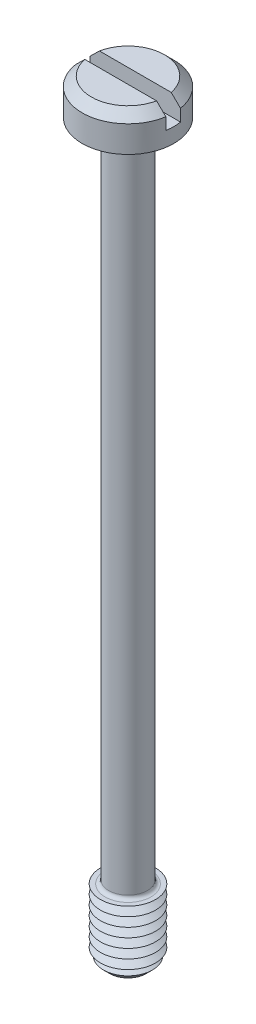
ISO-10303-21;
HEADER;
FILE_DESCRIPTION(('STEP AP214'),'2;1');
FILE_NAME('part.step','',(''),(''),'','','');
FILE_SCHEMA(('AUTOMOTIVE_DESIGN { 1 0 10303 214 1 1 1 1 }'));
ENDSEC;
DATA;
#1=APPLICATION_CONTEXT('core data for automotive mechanical design processes');
#2=APPLICATION_PROTOCOL_DEFINITION('international standard','automotive_design',2000,#1);
#3=PRODUCT_CONTEXT('',#1,'mechanical');
#4=PRODUCT('Part','Part','',(#3));
#5=PRODUCT_RELATED_PRODUCT_CATEGORY('part','',(#4));
#6=PRODUCT_DEFINITION_FORMATION('','',#4);
#7=PRODUCT_DEFINITION_CONTEXT('part definition',#1,'design');
#8=PRODUCT_DEFINITION('design','',#6,#7);
#9=PRODUCT_DEFINITION_SHAPE('','',#8);
#10=(LENGTH_UNIT() NAMED_UNIT(*) SI_UNIT(.MILLI.,.METRE.));
#11=(NAMED_UNIT(*) PLANE_ANGLE_UNIT() SI_UNIT($,.RADIAN.));
#12=(NAMED_UNIT(*) SI_UNIT($,.STERADIAN.) SOLID_ANGLE_UNIT());
#13=UNCERTAINTY_MEASURE_WITH_UNIT(LENGTH_MEASURE(1.E-05),#10,'distance_accuracy_value','');
#14=(GEOMETRIC_REPRESENTATION_CONTEXT(3) GLOBAL_UNCERTAINTY_ASSIGNED_CONTEXT((#13)) GLOBAL_UNIT_ASSIGNED_CONTEXT((#10,
#11,#12)) REPRESENTATION_CONTEXT('',''));
#15=CARTESIAN_POINT('',(0.,0.,0.));
#16=DIRECTION('',(0.,0.,1.));
#17=DIRECTION('',(1.,0.,0.));
#18=AXIS2_PLACEMENT_3D('',#15,#16,#17);
#19=CARTESIAN_POINT('',(0.,3.9,0.));
#20=DIRECTION('',(0.,1.,0.));
#21=DIRECTION('',(0.,0.,1.));
#22=AXIS2_PLACEMENT_3D('',#19,#20,#21);
#23=PLANE('',#22);
#24=DIRECTION('',(-1.,0.,0.));
#25=VECTOR('',#24,1.);
#26=CARTESIAN_POINT('',(5.,3.9,-0.8));
#27=LINE('',#26,#25);
#28=CARTESIAN_POINT('',(3.9191835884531,3.9,-0.8));
#29=VERTEX_POINT('',#28);
#30=CARTESIAN_POINT('',(-3.9191835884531,3.9,-0.8));
#31=VERTEX_POINT('',#30);
#32=EDGE_CURVE('E110',#29,#31,#27,.T.);
#33=ORIENTED_EDGE('',*,*,#32,.F.);
#34=CARTESIAN_POINT('',(0.,3.9,0.));
#35=DIRECTION('',(0.,1.,0.));
#36=DIRECTION('',(0.,0.,1.));
#37=AXIS2_PLACEMENT_3D('',#34,#35,#36);
#38=CIRCLE('',#37,4.00000000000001);
#39=EDGE_CURVE('E113',#29,#31,#38,.T.);
#40=ORIENTED_EDGE('',*,*,#39,.T.);
#41=EDGE_LOOP('',(#33,#40));
#42=FACE_BOUND('',#41,.T.);
#43=ADVANCED_FACE('F39',(#42),#23,.T.);
#44=CARTESIAN_POINT('',(0.,3.9,0.));
#45=DIRECTION('',(0.,-1.,0.));
#46=DIRECTION('',(0.,0.,-1.));
#47=AXIS2_PLACEMENT_3D('',#44,#45,#46);
#48=CONICAL_SURFACE('',#47,4.00000000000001,0.785398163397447);
#49=CARTESIAN_POINT('',(11.0010756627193,-3.13012537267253,-0.8));
#50=CARTESIAN_POINT('',(10.6180645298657,-2.74813121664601,-0.8));
#51=CARTESIAN_POINT('',(10.2350087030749,-2.3661818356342,-0.8));
#52=CARTESIAN_POINT('',(9.46873746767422,-1.60241986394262,-0.8));
#53=CARTESIAN_POINT('',(9.08552205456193,-1.22060727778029,-0.8));
#54=CARTESIAN_POINT('',(8.31861292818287,-0.456918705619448,-0.8));
#55=CARTESIAN_POINT('',(7.93491906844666,-0.0750428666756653,-0.8));
#56=CARTESIAN_POINT('',(7.16722555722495,0.688378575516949,-0.8));
#57=CARTESIAN_POINT('',(6.78322591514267,1.06992418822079,-0.8));
#58=CARTESIAN_POINT('',(6.01856215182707,1.82868912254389,-0.8));
#59=CARTESIAN_POINT('',(5.63790309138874,2.20591354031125,-0.8));
#60=CARTESIAN_POINT('',(5.06622054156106,2.77108317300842,-0.8));
#61=CARTESIAN_POINT('',(4.87553531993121,2.95937045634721,-0.8));
#62=CARTESIAN_POINT('',(4.49384424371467,3.33561647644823,-0.8));
#63=CARTESIAN_POINT('',(4.302838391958,3.52357521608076,-0.8));
#64=CARTESIAN_POINT('',(3.92044271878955,3.89893397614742,-0.8));
#65=CARTESIAN_POINT('',(3.7290531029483,4.08633420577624,-0.8));
#66=CARTESIAN_POINT('',(3.34554223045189,4.46039762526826,-0.8));
#67=CARTESIAN_POINT('',(3.15342094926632,4.64706078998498,-0.8));
#68=CARTESIAN_POINT('',(2.76802565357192,5.0191369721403,-0.8));
#69=CARTESIAN_POINT('',(2.57475182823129,5.20455018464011,-0.8));
#70=CARTESIAN_POINT('',(2.28318236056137,5.48091108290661,-0.8));
#71=CARTESIAN_POINT('',(2.1857187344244,5.5727357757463,-0.8));
#72=CARTESIAN_POINT('',(1.98998431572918,5.75552004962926,-0.8));
#73=CARTESIAN_POINT('',(1.89171354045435,5.84647964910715,-0.8));
#74=CARTESIAN_POINT('',(1.76578543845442,5.96147491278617,-0.8));
#75=CARTESIAN_POINT('',(1.73869031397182,5.986126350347,-0.8));
#76=CARTESIAN_POINT('',(1.68439529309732,6.03531372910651,-0.8));
#77=CARTESIAN_POINT('',(1.65719539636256,6.05984966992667,-0.8));
#78=CARTESIAN_POINT('',(1.57541627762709,6.13326356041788,-0.8));
#79=CARTESIAN_POINT('',(1.52066027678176,6.18194515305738,-0.8));
#80=CARTESIAN_POINT('',(1.41038257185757,6.27874171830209,-0.8));
#81=CARTESIAN_POINT('',(1.35485918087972,6.32685477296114,-0.8));
#82=CARTESIAN_POINT('',(1.24299231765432,6.42210730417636,-0.8));
#83=CARTESIAN_POINT('',(1.18664895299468,6.46924690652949,-0.8));
#84=CARTESIAN_POINT('',(1.07845249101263,6.55754663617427,-0.8));
#85=CARTESIAN_POINT('',(1.02670624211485,6.59883713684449,-0.8));
#86=CARTESIAN_POINT('',(0.921961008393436,6.67979338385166,-0.8));
#87=CARTESIAN_POINT('',(0.868962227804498,6.7194593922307,-0.8));
#88=CARTESIAN_POINT('',(0.761295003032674,6.79630361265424,-0.8));
#89=CARTESIAN_POINT('',(0.706629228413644,6.83348552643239,-0.8));
#90=CARTESIAN_POINT('',(0.594896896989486,6.90399895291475,-0.8));
#91=CARTESIAN_POINT('',(0.537833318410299,6.93733506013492,-0.8));
#92=CARTESIAN_POINT('',(0.428390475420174,6.99356340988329,-0.8));
#93=CARTESIAN_POINT('',(0.37643590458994,7.0172602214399,-0.8));
#94=CARTESIAN_POINT('',(0.269759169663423,7.05717670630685,-0.8));
#95=CARTESIAN_POINT('',(0.215046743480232,7.07342088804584,-0.8));
#96=CARTESIAN_POINT('',(0.113016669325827,7.09332110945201,-0.8));
#97=CARTESIAN_POINT('',(0.0660435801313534,7.09866042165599,-0.8));
#98=CARTESIAN_POINT('',(-0.0280587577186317,7.10088875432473,-0.8));
#99=CARTESIAN_POINT('',(-0.075187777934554,7.09778705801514,-0.8));
#100=CARTESIAN_POINT('',(-0.180723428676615,7.08192474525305,-0.8));
#101=CARTESIAN_POINT('',(-0.238762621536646,7.066795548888,-0.8));
#102=CARTESIAN_POINT('',(-0.323499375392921,7.03748409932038,-0.8));
#103=CARTESIAN_POINT('',(-0.351441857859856,7.0265659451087,-0.8));
#104=CARTESIAN_POINT('',(-0.406569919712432,7.00295901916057,-0.8));
#105=CARTESIAN_POINT('',(-0.433755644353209,6.99027059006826,-0.8));
#106=CARTESIAN_POINT('',(-0.504673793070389,6.95489235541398,-0.8));
#107=CARTESIAN_POINT('',(-0.547808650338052,6.93101671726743,-0.8));
#108=CARTESIAN_POINT('',(-0.632566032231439,6.88069648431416,-0.8));
#109=CARTESIAN_POINT('',(-0.674187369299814,6.85424992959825,-0.8));
#110=CARTESIAN_POINT('',(-0.756326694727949,6.79950439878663,-0.8));
#111=CARTESIAN_POINT('',(-0.796841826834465,6.77120117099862,-0.8));
#112=CARTESIAN_POINT('',(-0.876938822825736,6.71329852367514,-0.8));
#113=CARTESIAN_POINT('',(-0.916520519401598,6.68369887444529,-0.8));
#114=CARTESIAN_POINT('',(-1.03465904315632,6.59312324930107,-0.8));
#115=CARTESIAN_POINT('',(-1.11211338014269,6.53071425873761,-0.8));
#116=CARTESIAN_POINT('',(-1.26505454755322,6.40381418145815,-0.8));
#117=CARTESIAN_POINT('',(-1.34054439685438,6.33932667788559,-0.8));
#118=CARTESIAN_POINT('',(-1.48913173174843,6.20997083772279,-0.8));
#119=CARTESIAN_POINT('',(-1.56224816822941,6.14512422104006,-0.8));
#120=CARTESIAN_POINT('',(-1.7076539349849,6.01451044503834,-0.8));
#121=CARTESIAN_POINT('',(-1.77994324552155,5.94874326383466,-0.8));
#122=CARTESIAN_POINT('',(-1.99594639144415,5.75046596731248,-0.8));
#123=CARTESIAN_POINT('',(-2.13877767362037,5.61699583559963,-0.8));
#124=CARTESIAN_POINT('',(-2.42324632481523,5.34853800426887,-0.8));
#125=CARTESIAN_POINT('',(-2.56488247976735,5.21354902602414,-0.8));
#126=CARTESIAN_POINT('',(-2.84730929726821,4.94270932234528,-0.8));
#127=CARTESIAN_POINT('',(-2.98810001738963,4.80685865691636,-0.8));
#128=CARTESIAN_POINT('',(-3.2681876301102,4.53549974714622,-0.8));
#129=CARTESIAN_POINT('',(-3.4074882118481,4.39999530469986,-0.8));
#130=CARTESIAN_POINT('',(-3.68570899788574,4.12859172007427,-0.8));
#131=CARTESIAN_POINT('',(-3.82462919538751,3.99269257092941,-0.8));
#132=CARTESIAN_POINT('',(-4.24087543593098,3.58468153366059,-0.8));
#133=CARTESIAN_POINT('',(-4.5177930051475,3.31215310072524,-0.8));
#134=CARTESIAN_POINT('',(-5.052793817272,2.78443938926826,-0.8));
#135=CARTESIAN_POINT('',(-5.31091639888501,2.52929393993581,-0.8));
#136=CARTESIAN_POINT('',(-5.82680751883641,2.01864429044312,-0.8));
#137=CARTESIAN_POINT('',(-6.08457605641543,1.76314008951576,-0.8));
#138=CARTESIAN_POINT('',(-6.85760508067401,0.996194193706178,-0.8));
#139=CARTESIAN_POINT('',(-7.37251152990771,0.484395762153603,-0.8));
#140=CARTESIAN_POINT('',(-8.4065723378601,-0.544392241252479,-0.8));
#141=CARTESIAN_POINT('',(-8.92572224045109,-1.06138628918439,-0.8));
#142=CARTESIAN_POINT('',(-9.96362871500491,-2.09560660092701,-0.8));
#143=CARTESIAN_POINT('',(-10.4823853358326,-2.61283281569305,-0.8));
#144=CARTESIAN_POINT('',(-11.0010756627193,-3.13012537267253,-0.8));
#145=B_SPLINE_CURVE_WITH_KNOTS('',3,(#49,#50,#51,#52,#53,#54,#55,#56,#57,#58,#59,#60,#61,#62,
#63,#64,#65,#66,#67,#68,#69,#70,#71,#72,#73,#74,#75,#76,#77,#78,#79,#80,#81,#82,#83,#84,#85,#86,
#87,#88,#89,#90,#91,#92,#93,#94,#95,#96,#97,#98,#99,#100,#101,#102,#103,#104,#105,#106,#107,
#108,#109,#110,#111,#112,#113,#114,#115,#116,#117,#118,#119,#120,#121,#122,#123,#124,#125,#126,
#127,#128,#129,#130,#131,#132,#133,#134,#135,#136,#137,#138,#139,#140,#141,#142,#143,#144),
.UNSPECIFIED.,.F.,.F.,(4,2,2,2,2,2,2,2,2,2,2,2,2,2,2,2,2,2,2,2,2,2,2,2,2,2,2,2,2,2,2,2,2,2,2,2,
2,2,2,2,2,2,2,2,2,2,2,4),(0.,1.62282275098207,3.24569489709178,4.86971791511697,
6.49369278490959,8.10142191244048,8.90535980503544,9.7092906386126,10.5128682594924,
11.3164730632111,12.1199494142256,12.5216659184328,12.9233738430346,13.0332669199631,
13.1431603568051,13.3629580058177,13.5833578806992,13.8037290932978,14.0023112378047,
14.2008612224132,14.3991084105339,14.5971162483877,14.7680800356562,14.9384774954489,
15.0795987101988,15.2205647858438,15.3993585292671,15.4893211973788,15.5792664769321,
15.727032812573,15.8749126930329,16.0231439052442,16.1714014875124,16.4697244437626,
16.767558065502,17.0607348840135,17.35391868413,17.9403574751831,18.5273336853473,
19.1142694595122,19.6972736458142,20.2802881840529,21.4458742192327,22.5346981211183,
23.6235243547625,25.8015035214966,27.9995014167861,30.1971550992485),.UNSPECIFIED.);
#146=CARTESIAN_POINT('',(4.93558507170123,2.90000000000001,-0.8));
#147=VERTEX_POINT('',#146);
#148=EDGE_CURVE('E252',#147,#29,#145,.T.);
#149=ORIENTED_EDGE('',*,*,#148,.F.);
#150=CARTESIAN_POINT('',(0.,2.90000000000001,0.));
#151=DIRECTION('',(0.,1.,0.));
#152=DIRECTION('',(0.,0.,1.));
#153=AXIS2_PLACEMENT_3D('',#150,#151,#152);
#154=CIRCLE('',#153,5.);
#155=CARTESIAN_POINT('',(-4.93558507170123,2.90000000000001,-0.8));
#156=VERTEX_POINT('',#155);
#157=EDGE_CURVE('E128',#156,#147,#154,.F.);
#158=ORIENTED_EDGE('',*,*,#157,.F.);
#159=EDGE_CURVE('E102',#31,#156,#145,.T.);
#160=ORIENTED_EDGE('',*,*,#159,.F.);
#161=ORIENTED_EDGE('',*,*,#39,.F.);
#162=EDGE_LOOP('',(#149,#158,#160,#161));
#163=FACE_BOUND('',#162,.T.);
#164=ADVANCED_FACE('F214',(#163),#48,.T.);
#165=CARTESIAN_POINT('',(0.,-80.,0.));
#166=DIRECTION('',(0.,1.,0.));
#167=DIRECTION('',(0.,0.,1.));
#168=AXIS2_PLACEMENT_3D('',#165,#166,#167);
#169=CYLINDRICAL_SURFACE('',#168,2.1);
#170=CARTESIAN_POINT('',(0.,-72.1,0.));
#171=DIRECTION('',(0.,-1.,0.));
#172=DIRECTION('',(0.,0.,-1.));
#173=AXIS2_PLACEMENT_3D('',#170,#171,#172);
#174=CIRCLE('',#173,2.1);
#175=CARTESIAN_POINT('',(0.,-72.1,-2.1));
#176=VERTEX_POINT('',#175);
#177=EDGE_CURVE('E123',#176,#176,#174,.F.);
#178=ORIENTED_EDGE('',*,*,#177,.T.);
#179=EDGE_LOOP('',(#178));
#180=FACE_BOUND('',#179,.T.);
#181=CARTESIAN_POINT('',(0.,-0.399999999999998,0.));
#182=DIRECTION('',(0.,1.,0.));
#183=DIRECTION('',(0.,0.,1.));
#184=AXIS2_PLACEMENT_3D('',#181,#182,#183);
#185=CIRCLE('',#184,2.1);
#186=CARTESIAN_POINT('',(0.,-0.399999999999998,2.1));
#187=VERTEX_POINT('',#186);
#188=EDGE_CURVE('E349',#187,#187,#185,.F.);
#189=ORIENTED_EDGE('',*,*,#188,.T.);
#190=EDGE_LOOP('',(#189));
#191=FACE_BOUND('',#190,.T.);
#192=ADVANCED_FACE('F210',(#180,#191),#169,.T.);
#193=CARTESIAN_POINT('',(0.,3.9,0.));
#194=DIRECTION('',(0.,-1.,0.));
#195=DIRECTION('',(0.,0.,-1.));
#196=AXIS2_PLACEMENT_3D('',#193,#194,#195);
#197=CYLINDRICAL_SURFACE('',#196,5.);
#198=ORIENTED_EDGE('',*,*,#157,.T.);
#199=DIRECTION('',(0.,-1.,0.));
#200=VECTOR('',#199,1.);
#201=CARTESIAN_POINT('',(4.93558507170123,3.9,-0.8));
#202=LINE('',#201,#200);
#203=CARTESIAN_POINT('',(4.93558507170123,1.6,-0.8));
#204=VERTEX_POINT('',#203);
#205=EDGE_CURVE('E64',#147,#204,#202,.T.);
#206=ORIENTED_EDGE('',*,*,#205,.T.);
#207=CARTESIAN_POINT('',(0.,1.6,0.));
#208=DIRECTION('',(0.,1.,0.));
#209=DIRECTION('',(0.,0.,1.));
#210=AXIS2_PLACEMENT_3D('',#207,#208,#209);
#211=CIRCLE('',#210,5.);
#212=CARTESIAN_POINT('',(4.93558507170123,1.6,0.8));
#213=VERTEX_POINT('',#212);
#214=EDGE_CURVE('E11',#213,#204,#211,.T.);
#215=ORIENTED_EDGE('',*,*,#214,.F.);
#216=DIRECTION('',(0.,-1.,0.));
#217=VECTOR('',#216,1.);
#218=CARTESIAN_POINT('',(4.93558507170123,3.9,0.8));
#219=LINE('',#218,#217);
#220=CARTESIAN_POINT('',(4.93558507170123,2.90000000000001,0.8));
#221=VERTEX_POINT('',#220);
#222=EDGE_CURVE('E268',#213,#221,#219,.F.);
#223=ORIENTED_EDGE('',*,*,#222,.T.);
#224=CARTESIAN_POINT('',(-4.93558507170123,2.90000000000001,0.8));
#225=VERTEX_POINT('',#224);
#226=EDGE_CURVE('E120',#221,#225,#154,.F.);
#227=ORIENTED_EDGE('',*,*,#226,.T.);
#228=DIRECTION('',(0.,-1.,0.));
#229=VECTOR('',#228,1.);
#230=CARTESIAN_POINT('',(-4.93558507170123,3.9,0.8));
#231=LINE('',#230,#229);
#232=CARTESIAN_POINT('',(-4.93558507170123,1.6,0.8));
#233=VERTEX_POINT('',#232);
#234=EDGE_CURVE('E96',#225,#233,#231,.T.);
#235=ORIENTED_EDGE('',*,*,#234,.T.);
#236=CARTESIAN_POINT('',(-4.93558507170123,1.6,-0.8));
#237=VERTEX_POINT('',#236);
#238=EDGE_CURVE('E44',#237,#233,#211,.T.);
#239=ORIENTED_EDGE('',*,*,#238,.F.);
#240=DIRECTION('',(0.,-1.,0.));
#241=VECTOR('',#240,1.);
#242=CARTESIAN_POINT('',(-4.93558507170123,3.9,-0.8));
#243=LINE('',#242,#241);
#244=EDGE_CURVE('E271',#237,#156,#243,.F.);
#245=ORIENTED_EDGE('',*,*,#244,.T.);
#246=EDGE_LOOP('',(#198,#206,#215,#223,#227,#235,#239,#245));
#247=FACE_BOUND('',#246,.T.);
#248=CARTESIAN_POINT('',(0.,0.,0.));
#249=DIRECTION('',(0.,1.,0.));
#250=DIRECTION('',(0.,0.,1.));
#251=AXIS2_PLACEMENT_3D('',#248,#249,#250);
#252=CIRCLE('',#251,5.);
#253=CARTESIAN_POINT('',(0.,0.,5.));
#254=VERTEX_POINT('',#253);
#255=EDGE_CURVE('E334',#254,#254,#252,.T.);
#256=ORIENTED_EDGE('',*,*,#255,.T.);
#257=EDGE_LOOP('',(#256));
#258=FACE_BOUND('',#257,.T.);
#259=ADVANCED_FACE('F213',(#247,#258),#197,.T.);
#260=DIRECTION('',(1.,0.,0.));
#261=VECTOR('',#260,1.);
#262=CARTESIAN_POINT('',(5.,3.9,0.8));
#263=LINE('',#262,#261);
#264=CARTESIAN_POINT('',(-3.9191835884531,3.9,0.8));
#265=VERTEX_POINT('',#264);
#266=CARTESIAN_POINT('',(3.9191835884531,3.9,0.8));
#267=VERTEX_POINT('',#266);
#268=EDGE_CURVE('E56',#265,#267,#263,.T.);
#269=ORIENTED_EDGE('',*,*,#268,.F.);
#270=EDGE_CURVE('E108',#265,#267,#38,.T.);
#271=ORIENTED_EDGE('',*,*,#270,.T.);
#272=EDGE_LOOP('',(#269,#271));
#273=FACE_BOUND('',#272,.T.);
#274=ADVANCED_FACE('F107',(#273),#23,.T.);
#275=CARTESIAN_POINT('',(0.,0.,0.));
#276=DIRECTION('',(0.,1.,0.));
#277=DIRECTION('',(0.,0.,1.));
#278=AXIS2_PLACEMENT_3D('',#275,#276,#277);
#279=PLANE('',#278);
#280=CARTESIAN_POINT('',(0.,0.,0.));
#281=DIRECTION('',(0.,1.,0.));
#282=DIRECTION('',(0.,0.,1.));
#283=AXIS2_PLACEMENT_3D('',#280,#281,#282);
#284=CIRCLE('',#283,2.5);
#285=CARTESIAN_POINT('',(0.,0.,2.5));
#286=VERTEX_POINT('',#285);
#287=EDGE_CURVE('E114',#286,#286,#284,.T.);
#288=ORIENTED_EDGE('',*,*,#287,.T.);
#289=EDGE_LOOP('',(#288));
#290=FACE_BOUND('',#289,.T.);
#291=ORIENTED_EDGE('',*,*,#255,.F.);
#292=EDGE_LOOP('',(#291));
#293=FACE_BOUND('',#292,.T.);
#294=ADVANCED_FACE('F204',(#290,#293),#279,.F.);
#295=CARTESIAN_POINT('',(0.,-72.5,0.));
#296=DIRECTION('',(0.,-1.,0.));
#297=DIRECTION('',(0.,0.,-1.));
#298=AXIS2_PLACEMENT_3D('',#295,#296,#297);
#299=PLANE('',#298);
#300=CARTESIAN_POINT('',(0.,-72.5,0.));
#301=DIRECTION('',(0.,-1.,0.));
#302=DIRECTION('',(0.,0.,-1.));
#303=AXIS2_PLACEMENT_3D('',#300,#301,#302);
#304=CIRCLE('',#303,2.5);
#305=CARTESIAN_POINT('',(0.,-72.5,-2.5));
#306=VERTEX_POINT('',#305);
#307=EDGE_CURVE('E342',#306,#306,#304,.T.);
#308=ORIENTED_EDGE('',*,*,#307,.T.);
#309=EDGE_LOOP('',(#308));
#310=FACE_BOUND('',#309,.T.);
#311=CARTESIAN_POINT('',(0.,-72.5,0.));
#312=DIRECTION('',(0.,1.,0.));
#313=DIRECTION('',(0.,0.,1.));
#314=AXIS2_PLACEMENT_3D('',#311,#312,#313);
#315=CIRCLE('',#314,3.);
#316=CARTESIAN_POINT('',(0.,-72.5,3.));
#317=VERTEX_POINT('',#316);
#318=EDGE_CURVE('E330',#317,#317,#315,.T.);
#319=ORIENTED_EDGE('',*,*,#318,.T.);
#320=EDGE_LOOP('',(#319));
#321=FACE_BOUND('',#320,.T.);
#322=ADVANCED_FACE('F200',(#310,#321),#299,.F.);
#323=CARTESIAN_POINT('',(0.,-73.,0.));
#324=DIRECTION('',(0.,1.,0.));
#325=DIRECTION('',(0.,0.,1.));
#326=AXIS2_PLACEMENT_3D('',#323,#324,#325);
#327=CONICAL_SURFACE('',#326,2.13397459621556,1.0471975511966);
#328=ORIENTED_EDGE('',*,*,#318,.F.);
#329=EDGE_LOOP('',(#328));
#330=FACE_BOUND('',#329,.T.);
#331=CARTESIAN_POINT('',(0.,-73.,0.));
#332=DIRECTION('',(0.,1.,0.));
#333=DIRECTION('',(0.,0.,1.));
#334=AXIS2_PLACEMENT_3D('',#331,#332,#333);
#335=CIRCLE('',#334,2.13397459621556);
#336=CARTESIAN_POINT('',(0.,-73.,2.13397459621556));
#337=VERTEX_POINT('',#336);
#338=EDGE_CURVE('E326',#337,#337,#335,.T.);
#339=ORIENTED_EDGE('',*,*,#338,.T.);
#340=EDGE_LOOP('',(#339));
#341=FACE_BOUND('',#340,.T.);
#342=ADVANCED_FACE('F196',(#330,#341),#327,.T.);
#343=CARTESIAN_POINT('',(0.,-73.5,0.));
#344=DIRECTION('',(0.,-1.,0.));
#345=DIRECTION('',(0.,0.,-1.));
#346=AXIS2_PLACEMENT_3D('',#343,#344,#345);
#347=CONICAL_SURFACE('',#346,3.,1.0471975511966);
#348=ORIENTED_EDGE('',*,*,#338,.F.);
#349=EDGE_LOOP('',(#348));
#350=FACE_BOUND('',#349,.T.);
#351=CARTESIAN_POINT('',(0.,-73.5,0.));
#352=DIRECTION('',(0.,1.,0.));
#353=DIRECTION('',(0.,0.,1.));
#354=AXIS2_PLACEMENT_3D('',#351,#352,#353);
#355=CIRCLE('',#354,3.);
#356=CARTESIAN_POINT('',(0.,-73.5,3.));
#357=VERTEX_POINT('',#356);
#358=EDGE_CURVE('E322',#357,#357,#355,.T.);
#359=ORIENTED_EDGE('',*,*,#358,.T.);
#360=EDGE_LOOP('',(#359));
#361=FACE_BOUND('',#360,.T.);
#362=ADVANCED_FACE('F192',(#350,#361),#347,.T.);
#363=CARTESIAN_POINT('',(0.,-74.,0.));
#364=DIRECTION('',(0.,1.,0.));
#365=DIRECTION('',(0.,0.,1.));
#366=AXIS2_PLACEMENT_3D('',#363,#364,#365);
#367=CONICAL_SURFACE('',#366,2.13397459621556,1.0471975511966);
#368=ORIENTED_EDGE('',*,*,#358,.F.);
#369=EDGE_LOOP('',(#368));
#370=FACE_BOUND('',#369,.T.);
#371=CARTESIAN_POINT('',(0.,-74.,0.));
#372=DIRECTION('',(0.,1.,0.));
#373=DIRECTION('',(0.,0.,1.));
#374=AXIS2_PLACEMENT_3D('',#371,#372,#373);
#375=CIRCLE('',#374,2.13397459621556);
#376=CARTESIAN_POINT('',(0.,-74.,2.13397459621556));
#377=VERTEX_POINT('',#376);
#378=EDGE_CURVE('E319',#377,#377,#375,.T.);
#379=ORIENTED_EDGE('',*,*,#378,.T.);
#380=EDGE_LOOP('',(#379));
#381=FACE_BOUND('',#380,.T.);
#382=ADVANCED_FACE('F188',(#370,#381),#367,.T.);
#383=CARTESIAN_POINT('',(0.,-74.5,0.));
#384=DIRECTION('',(0.,-1.,0.));
#385=DIRECTION('',(0.,0.,-1.));
#386=AXIS2_PLACEMENT_3D('',#383,#384,#385);
#387=CONICAL_SURFACE('',#386,3.,1.0471975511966);
#388=ORIENTED_EDGE('',*,*,#378,.F.);
#389=EDGE_LOOP('',(#388));
#390=FACE_BOUND('',#389,.T.);
#391=CARTESIAN_POINT('',(0.,-74.5,0.));
#392=DIRECTION('',(0.,1.,0.));
#393=DIRECTION('',(0.,0.,1.));
#394=AXIS2_PLACEMENT_3D('',#391,#392,#393);
#395=CIRCLE('',#394,3.);
#396=CARTESIAN_POINT('',(0.,-74.5,3.));
#397=VERTEX_POINT('',#396);
#398=EDGE_CURVE('E315',#397,#397,#395,.T.);
#399=ORIENTED_EDGE('',*,*,#398,.T.);
#400=EDGE_LOOP('',(#399));
#401=FACE_BOUND('',#400,.T.);
#402=ADVANCED_FACE('F184',(#390,#401),#387,.T.);
#403=CARTESIAN_POINT('',(0.,-75.,0.));
#404=DIRECTION('',(0.,1.,0.));
#405=DIRECTION('',(0.,0.,1.));
#406=AXIS2_PLACEMENT_3D('',#403,#404,#405);
#407=CONICAL_SURFACE('',#406,2.13397459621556,1.0471975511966);
#408=ORIENTED_EDGE('',*,*,#398,.F.);
#409=EDGE_LOOP('',(#408));
#410=FACE_BOUND('',#409,.T.);
#411=CARTESIAN_POINT('',(0.,-75.,0.));
#412=DIRECTION('',(0.,1.,0.));
#413=DIRECTION('',(0.,0.,1.));
#414=AXIS2_PLACEMENT_3D('',#411,#412,#413);
#415=CIRCLE('',#414,2.13397459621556);
#416=CARTESIAN_POINT('',(0.,-75.,2.13397459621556));
#417=VERTEX_POINT('',#416);
#418=EDGE_CURVE('E312',#417,#417,#415,.T.);
#419=ORIENTED_EDGE('',*,*,#418,.T.);
#420=EDGE_LOOP('',(#419));
#421=FACE_BOUND('',#420,.T.);
#422=ADVANCED_FACE('F180',(#410,#421),#407,.T.);
#423=CARTESIAN_POINT('',(0.,-75.5,0.));
#424=DIRECTION('',(0.,-1.,0.));
#425=DIRECTION('',(0.,0.,-1.));
#426=AXIS2_PLACEMENT_3D('',#423,#424,#425);
#427=CONICAL_SURFACE('',#426,3.,1.0471975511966);
#428=ORIENTED_EDGE('',*,*,#418,.F.);
#429=EDGE_LOOP('',(#428));
#430=FACE_BOUND('',#429,.T.);
#431=CARTESIAN_POINT('',(0.,-75.5,0.));
#432=DIRECTION('',(0.,1.,0.));
#433=DIRECTION('',(0.,0.,1.));
#434=AXIS2_PLACEMENT_3D('',#431,#432,#433);
#435=CIRCLE('',#434,3.);
#436=CARTESIAN_POINT('',(0.,-75.5,3.));
#437=VERTEX_POINT('',#436);
#438=EDGE_CURVE('E308',#437,#437,#435,.T.);
#439=ORIENTED_EDGE('',*,*,#438,.T.);
#440=EDGE_LOOP('',(#439));
#441=FACE_BOUND('',#440,.T.);
#442=ADVANCED_FACE('F176',(#430,#441),#427,.T.);
#443=CARTESIAN_POINT('',(0.,-76.,0.));
#444=DIRECTION('',(0.,1.,0.));
#445=DIRECTION('',(0.,0.,1.));
#446=AXIS2_PLACEMENT_3D('',#443,#444,#445);
#447=CONICAL_SURFACE('',#446,2.13397459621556,1.0471975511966);
#448=ORIENTED_EDGE('',*,*,#438,.F.);
#449=EDGE_LOOP('',(#448));
#450=FACE_BOUND('',#449,.T.);
#451=CARTESIAN_POINT('',(0.,-76.,0.));
#452=DIRECTION('',(0.,1.,0.));
#453=DIRECTION('',(0.,0.,1.));
#454=AXIS2_PLACEMENT_3D('',#451,#452,#453);
#455=CIRCLE('',#454,2.13397459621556);
#456=CARTESIAN_POINT('',(0.,-76.,2.13397459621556));
#457=VERTEX_POINT('',#456);
#458=EDGE_CURVE('E305',#457,#457,#455,.T.);
#459=ORIENTED_EDGE('',*,*,#458,.T.);
#460=EDGE_LOOP('',(#459));
#461=FACE_BOUND('',#460,.T.);
#462=ADVANCED_FACE('F172',(#450,#461),#447,.T.);
#463=CARTESIAN_POINT('',(0.,-76.5,0.));
#464=DIRECTION('',(0.,-1.,0.));
#465=DIRECTION('',(0.,0.,-1.));
#466=AXIS2_PLACEMENT_3D('',#463,#464,#465);
#467=CONICAL_SURFACE('',#466,3.,1.0471975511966);
#468=ORIENTED_EDGE('',*,*,#458,.F.);
#469=EDGE_LOOP('',(#468));
#470=FACE_BOUND('',#469,.T.);
#471=CARTESIAN_POINT('',(0.,-76.5,0.));
#472=DIRECTION('',(0.,1.,0.));
#473=DIRECTION('',(0.,0.,1.));
#474=AXIS2_PLACEMENT_3D('',#471,#472,#473);
#475=CIRCLE('',#474,3.);
#476=CARTESIAN_POINT('',(0.,-76.5,3.));
#477=VERTEX_POINT('',#476);
#478=EDGE_CURVE('E301',#477,#477,#475,.T.);
#479=ORIENTED_EDGE('',*,*,#478,.T.);
#480=EDGE_LOOP('',(#479));
#481=FACE_BOUND('',#480,.T.);
#482=ADVANCED_FACE('F168',(#470,#481),#467,.T.);
#483=CARTESIAN_POINT('',(0.,-77.,0.));
#484=DIRECTION('',(0.,1.,0.));
#485=DIRECTION('',(0.,0.,1.));
#486=AXIS2_PLACEMENT_3D('',#483,#484,#485);
#487=CONICAL_SURFACE('',#486,2.13397459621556,1.0471975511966);
#488=ORIENTED_EDGE('',*,*,#478,.F.);
#489=EDGE_LOOP('',(#488));
#490=FACE_BOUND('',#489,.T.);
#491=CARTESIAN_POINT('',(0.,-77.,0.));
#492=DIRECTION('',(0.,1.,0.));
#493=DIRECTION('',(0.,0.,1.));
#494=AXIS2_PLACEMENT_3D('',#491,#492,#493);
#495=CIRCLE('',#494,2.13397459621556);
#496=CARTESIAN_POINT('',(0.,-77.,2.13397459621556));
#497=VERTEX_POINT('',#496);
#498=EDGE_CURVE('E297',#497,#497,#495,.T.);
#499=ORIENTED_EDGE('',*,*,#498,.T.);
#500=EDGE_LOOP('',(#499));
#501=FACE_BOUND('',#500,.T.);
#502=ADVANCED_FACE('F164',(#490,#501),#487,.T.);
#503=CARTESIAN_POINT('',(0.,-77.5,0.));
#504=DIRECTION('',(0.,-1.,0.));
#505=DIRECTION('',(0.,0.,-1.));
#506=AXIS2_PLACEMENT_3D('',#503,#504,#505);
#507=CONICAL_SURFACE('',#506,3.,1.0471975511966);
#508=ORIENTED_EDGE('',*,*,#498,.F.);
#509=EDGE_LOOP('',(#508));
#510=FACE_BOUND('',#509,.T.);
#511=CARTESIAN_POINT('',(0.,-77.5,0.));
#512=DIRECTION('',(0.,1.,0.));
#513=DIRECTION('',(0.,0.,1.));
#514=AXIS2_PLACEMENT_3D('',#511,#512,#513);
#515=CIRCLE('',#514,3.);
#516=CARTESIAN_POINT('',(0.,-77.5,3.));
#517=VERTEX_POINT('',#516);
#518=EDGE_CURVE('E294',#517,#517,#515,.T.);
#519=ORIENTED_EDGE('',*,*,#518,.T.);
#520=EDGE_LOOP('',(#519));
#521=FACE_BOUND('',#520,.T.);
#522=ADVANCED_FACE('F160',(#510,#521),#507,.T.);
#523=CARTESIAN_POINT('',(0.,-78.,0.));
#524=DIRECTION('',(0.,1.,0.));
#525=DIRECTION('',(0.,0.,1.));
#526=AXIS2_PLACEMENT_3D('',#523,#524,#525);
#527=CONICAL_SURFACE('',#526,2.13397459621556,1.0471975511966);
#528=ORIENTED_EDGE('',*,*,#518,.F.);
#529=EDGE_LOOP('',(#528));
#530=FACE_BOUND('',#529,.T.);
#531=CARTESIAN_POINT('',(0.,-78.,0.));
#532=DIRECTION('',(0.,1.,0.));
#533=DIRECTION('',(0.,0.,1.));
#534=AXIS2_PLACEMENT_3D('',#531,#532,#533);
#535=CIRCLE('',#534,2.13397459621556);
#536=CARTESIAN_POINT('',(0.,-78.,2.13397459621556));
#537=VERTEX_POINT('',#536);
#538=EDGE_CURVE('E290',#537,#537,#535,.T.);
#539=ORIENTED_EDGE('',*,*,#538,.T.);
#540=EDGE_LOOP('',(#539));
#541=FACE_BOUND('',#540,.T.);
#542=ADVANCED_FACE('F156',(#530,#541),#527,.T.);
#543=CARTESIAN_POINT('',(0.,-78.5,0.));
#544=DIRECTION('',(0.,-1.,0.));
#545=DIRECTION('',(0.,0.,-1.));
#546=AXIS2_PLACEMENT_3D('',#543,#544,#545);
#547=CONICAL_SURFACE('',#546,3.,1.0471975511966);
#548=ORIENTED_EDGE('',*,*,#538,.F.);
#549=EDGE_LOOP('',(#548));
#550=FACE_BOUND('',#549,.T.);
#551=CARTESIAN_POINT('',(0.,-78.5,0.));
#552=DIRECTION('',(0.,1.,0.));
#553=DIRECTION('',(0.,0.,1.));
#554=AXIS2_PLACEMENT_3D('',#551,#552,#553);
#555=CIRCLE('',#554,3.);
#556=CARTESIAN_POINT('',(0.,-78.5,3.));
#557=VERTEX_POINT('',#556);
#558=EDGE_CURVE('E285',#557,#557,#555,.T.);
#559=ORIENTED_EDGE('',*,*,#558,.T.);
#560=EDGE_LOOP('',(#559));
#561=FACE_BOUND('',#560,.T.);
#562=ADVANCED_FACE('F152',(#550,#561),#547,.T.);
#563=CARTESIAN_POINT('',(0.,-79.,0.));
#564=DIRECTION('',(0.,1.,0.));
#565=DIRECTION('',(0.,0.,1.));
#566=AXIS2_PLACEMENT_3D('',#563,#564,#565);
#567=CONICAL_SURFACE('',#566,2.13397459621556,1.0471975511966);
#568=ORIENTED_EDGE('',*,*,#558,.F.);
#569=EDGE_LOOP('',(#568));
#570=FACE_BOUND('',#569,.T.);
#571=CARTESIAN_POINT('',(0.,-79.,0.));
#572=DIRECTION('',(0.,1.,0.));
#573=DIRECTION('',(0.,0.,1.));
#574=AXIS2_PLACEMENT_3D('',#571,#572,#573);
#575=CIRCLE('',#574,2.13397459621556);
#576=CARTESIAN_POINT('',(0.,-79.,2.13397459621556));
#577=VERTEX_POINT('',#576);
#578=EDGE_CURVE('E281',#577,#577,#575,.T.);
#579=ORIENTED_EDGE('',*,*,#578,.T.);
#580=EDGE_LOOP('',(#579));
#581=FACE_BOUND('',#580,.T.);
#582=ADVANCED_FACE('F148',(#570,#581),#567,.T.);
#583=CARTESIAN_POINT('',(0.,-79.5,0.));
#584=DIRECTION('',(0.,-1.,0.));
#585=DIRECTION('',(0.,0.,-1.));
#586=AXIS2_PLACEMENT_3D('',#583,#584,#585);
#587=CONICAL_SURFACE('',#586,3.,1.0471975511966);
#588=CARTESIAN_POINT('',(0.,-79.3169872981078,0.));
#589=DIRECTION('',(0.,-1.,0.));
#590=DIRECTION('',(0.,0.,-1.));
#591=AXIS2_PLACEMENT_3D('',#588,#589,#590);
#592=CIRCLE('',#591,2.68301270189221);
#593=CARTESIAN_POINT('',(0.,-79.3169872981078,-2.68301270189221));
#594=VERTEX_POINT('',#593);
#595=EDGE_CURVE('E289',#594,#594,#592,.F.);
#596=ORIENTED_EDGE('',*,*,#595,.T.);
#597=EDGE_LOOP('',(#596));
#598=FACE_BOUND('',#597,.T.);
#599=ORIENTED_EDGE('',*,*,#578,.F.);
#600=EDGE_LOOP('',(#599));
#601=FACE_BOUND('',#600,.T.);
#602=ADVANCED_FACE('F144',(#598,#601),#587,.T.);
#603=CARTESIAN_POINT('',(0.,-80.,0.));
#604=DIRECTION('',(0.,-1.,0.));
#605=DIRECTION('',(0.,0.,-1.));
#606=AXIS2_PLACEMENT_3D('',#603,#604,#605);
#607=PLANE('',#606);
#608=CARTESIAN_POINT('',(0.,-80.,0.));
#609=DIRECTION('',(0.,-1.,0.));
#610=DIRECTION('',(0.,0.,-1.));
#611=AXIS2_PLACEMENT_3D('',#608,#609,#610);
#612=CIRCLE('',#611,2.00000000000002);
#613=CARTESIAN_POINT('',(0.,-80.,-2.00000000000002));
#614=VERTEX_POINT('',#613);
#615=EDGE_CURVE('E338',#614,#614,#612,.T.);
#616=ORIENTED_EDGE('',*,*,#615,.T.);
#617=EDGE_LOOP('',(#616));
#618=FACE_BOUND('',#617,.T.);
#619=ADVANCED_FACE('F147',(#618),#607,.T.);
#620=CARTESIAN_POINT('',(0.,-80.,0.));
#621=DIRECTION('',(0.,1.,0.));
#622=DIRECTION('',(0.,0.,1.));
#623=AXIS2_PLACEMENT_3D('',#620,#621,#622);
#624=CONICAL_SURFACE('',#623,2.00000000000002,0.785398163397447);
#625=ORIENTED_EDGE('',*,*,#595,.F.);
#626=EDGE_LOOP('',(#625));
#627=FACE_BOUND('',#626,.T.);
#628=ORIENTED_EDGE('',*,*,#615,.F.);
#629=EDGE_LOOP('',(#628));
#630=FACE_BOUND('',#629,.T.);
#631=ADVANCED_FACE('F208',(#627,#630),#624,.T.);
#632=CARTESIAN_POINT('',(0.,-72.1,0.));
#633=DIRECTION('',(0.,-1.,0.));
#634=DIRECTION('',(0.,0.,-1.));
#635=AXIS2_PLACEMENT_3D('',#632,#633,#634);
#636=TOROIDAL_SURFACE('',#635,2.5,0.4);
#637=ORIENTED_EDGE('',*,*,#177,.F.);
#638=EDGE_LOOP('',(#637));
#639=FACE_BOUND('',#638,.T.);
#640=ORIENTED_EDGE('',*,*,#307,.F.);
#641=EDGE_LOOP('',(#640));
#642=FACE_BOUND('',#641,.T.);
#643=ADVANCED_FACE('F226',(#639,#642),#636,.F.);
#644=CARTESIAN_POINT('',(0.,-0.399999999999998,0.));
#645=DIRECTION('',(0.,1.,0.));
#646=DIRECTION('',(0.,0.,1.));
#647=AXIS2_PLACEMENT_3D('',#644,#645,#646);
#648=TOROIDAL_SURFACE('',#647,2.5,0.4);
#649=ORIENTED_EDGE('',*,*,#287,.F.);
#650=EDGE_LOOP('',(#649));
#651=FACE_BOUND('',#650,.T.);
#652=ORIENTED_EDGE('',*,*,#188,.F.);
#653=EDGE_LOOP('',(#652));
#654=FACE_BOUND('',#653,.T.);
#655=ADVANCED_FACE('F229',(#651,#654),#648,.F.);
#656=CARTESIAN_POINT('',(-11.0010756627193,-3.13012537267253,0.8));
#657=CARTESIAN_POINT('',(-10.6180645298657,-2.74813121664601,0.8));
#658=CARTESIAN_POINT('',(-10.2350087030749,-2.3661818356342,0.8));
#659=CARTESIAN_POINT('',(-9.46873746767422,-1.60241986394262,0.8));
#660=CARTESIAN_POINT('',(-9.08552205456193,-1.22060727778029,0.8));
#661=CARTESIAN_POINT('',(-8.31861292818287,-0.456918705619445,0.8));
#662=CARTESIAN_POINT('',(-7.93491906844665,-0.0750428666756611,0.8));
#663=CARTESIAN_POINT('',(-7.16722555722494,0.688378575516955,0.8));
#664=CARTESIAN_POINT('',(-6.78322591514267,1.06992418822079,0.8));
#665=CARTESIAN_POINT('',(-6.01856215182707,1.8286891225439,0.8));
#666=CARTESIAN_POINT('',(-5.63790309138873,2.20591354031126,0.8));
#667=CARTESIAN_POINT('',(-5.06622054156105,2.77108317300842,0.8));
#668=CARTESIAN_POINT('',(-4.87553531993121,2.95937045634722,0.8));
#669=CARTESIAN_POINT('',(-4.49384424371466,3.33561647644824,0.8));
#670=CARTESIAN_POINT('',(-4.302838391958,3.52357521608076,0.8));
#671=CARTESIAN_POINT('',(-3.92044271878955,3.89893397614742,0.8));
#672=CARTESIAN_POINT('',(-3.7290531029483,4.08633420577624,0.8));
#673=CARTESIAN_POINT('',(-3.34554223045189,4.46039762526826,0.8));
#674=CARTESIAN_POINT('',(-3.15342094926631,4.64706078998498,0.8));
#675=CARTESIAN_POINT('',(-2.76802565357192,5.0191369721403,0.8));
#676=CARTESIAN_POINT('',(-2.57475182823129,5.20455018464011,0.8));
#677=CARTESIAN_POINT('',(-2.28318236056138,5.48091108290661,0.8));
#678=CARTESIAN_POINT('',(-2.1857187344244,5.5727357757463,0.8));
#679=CARTESIAN_POINT('',(-1.98998431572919,5.75552004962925,0.8));
#680=CARTESIAN_POINT('',(-1.89171354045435,5.84647964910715,0.8));
#681=CARTESIAN_POINT('',(-1.76578543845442,5.96147491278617,0.8));
#682=CARTESIAN_POINT('',(-1.73869031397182,5.986126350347,0.8));
#683=CARTESIAN_POINT('',(-1.68439529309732,6.03531372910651,0.8));
#684=CARTESIAN_POINT('',(-1.65719539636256,6.05984966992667,0.8));
#685=CARTESIAN_POINT('',(-1.5754162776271,6.13326356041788,0.8));
#686=CARTESIAN_POINT('',(-1.52066027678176,6.18194515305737,0.8));
#687=CARTESIAN_POINT('',(-1.41038257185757,6.27874171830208,0.8));
#688=CARTESIAN_POINT('',(-1.35485918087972,6.32685477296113,0.8));
#689=CARTESIAN_POINT('',(-1.24299231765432,6.42210730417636,0.8));
#690=CARTESIAN_POINT('',(-1.18664895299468,6.46924690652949,0.8));
#691=CARTESIAN_POINT('',(-1.07845249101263,6.55754663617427,0.8));
#692=CARTESIAN_POINT('',(-1.02670624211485,6.59883713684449,0.8));
#693=CARTESIAN_POINT('',(-0.921961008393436,6.67979338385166,0.8));
#694=CARTESIAN_POINT('',(-0.868962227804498,6.7194593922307,0.8));
#695=CARTESIAN_POINT('',(-0.761295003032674,6.79630361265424,0.8));
#696=CARTESIAN_POINT('',(-0.706629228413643,6.83348552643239,0.8));
#697=CARTESIAN_POINT('',(-0.594896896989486,6.90399895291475,0.8));
#698=CARTESIAN_POINT('',(-0.537833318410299,6.93733506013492,0.8));
#699=CARTESIAN_POINT('',(-0.428390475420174,6.99356340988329,0.8));
#700=CARTESIAN_POINT('',(-0.37643590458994,7.0172602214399,0.8));
#701=CARTESIAN_POINT('',(-0.269759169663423,7.05717670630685,0.8));
#702=CARTESIAN_POINT('',(-0.215046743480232,7.07342088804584,0.8));
#703=CARTESIAN_POINT('',(-0.113016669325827,7.09332110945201,0.8));
#704=CARTESIAN_POINT('',(-0.0660435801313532,7.09866042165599,0.8));
#705=CARTESIAN_POINT('',(0.0280587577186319,7.10088875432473,0.8));
#706=CARTESIAN_POINT('',(0.0751877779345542,7.09778705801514,0.8));
#707=CARTESIAN_POINT('',(0.180723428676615,7.08192474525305,0.8));
#708=CARTESIAN_POINT('',(0.238762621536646,7.066795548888,0.8));
#709=CARTESIAN_POINT('',(0.323499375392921,7.03748409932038,0.8));
#710=CARTESIAN_POINT('',(0.351441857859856,7.0265659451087,0.8));
#711=CARTESIAN_POINT('',(0.406569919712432,7.00295901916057,0.8));
#712=CARTESIAN_POINT('',(0.433755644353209,6.99027059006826,0.8));
#713=CARTESIAN_POINT('',(0.504673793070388,6.95489235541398,0.8));
#714=CARTESIAN_POINT('',(0.547808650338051,6.93101671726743,0.8));
#715=CARTESIAN_POINT('',(0.632566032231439,6.88069648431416,0.8));
#716=CARTESIAN_POINT('',(0.674187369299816,6.85424992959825,0.8));
#717=CARTESIAN_POINT('',(0.75632669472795,6.79950439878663,0.8));
#718=CARTESIAN_POINT('',(0.796841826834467,6.77120117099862,0.8));
#719=CARTESIAN_POINT('',(0.876938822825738,6.71329852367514,0.8));
#720=CARTESIAN_POINT('',(0.916520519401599,6.68369887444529,0.8));
#721=CARTESIAN_POINT('',(1.03465904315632,6.59312324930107,0.8));
#722=CARTESIAN_POINT('',(1.11211338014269,6.53071425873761,0.8));
#723=CARTESIAN_POINT('',(1.26505454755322,6.40381418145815,0.8));
#724=CARTESIAN_POINT('',(1.34054439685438,6.33932667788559,0.8));
#725=CARTESIAN_POINT('',(1.48913173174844,6.20997083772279,0.8));
#726=CARTESIAN_POINT('',(1.56224816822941,6.14512422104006,0.8));
#727=CARTESIAN_POINT('',(1.7076539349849,6.01451044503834,0.8));
#728=CARTESIAN_POINT('',(1.77994324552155,5.94874326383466,0.8));
#729=CARTESIAN_POINT('',(1.99594639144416,5.75046596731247,0.8));
#730=CARTESIAN_POINT('',(2.13877767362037,5.61699583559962,0.8));
#731=CARTESIAN_POINT('',(2.42324632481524,5.34853800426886,0.8));
#732=CARTESIAN_POINT('',(2.56488247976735,5.21354902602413,0.8));
#733=CARTESIAN_POINT('',(2.84730929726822,4.94270932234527,0.8));
#734=CARTESIAN_POINT('',(2.98810001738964,4.80685865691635,0.8));
#735=CARTESIAN_POINT('',(3.26818763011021,4.53549974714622,0.8));
#736=CARTESIAN_POINT('',(3.40748821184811,4.39999530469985,0.8));
#737=CARTESIAN_POINT('',(3.68570899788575,4.12859172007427,0.8));
#738=CARTESIAN_POINT('',(3.82462919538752,3.9926925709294,0.8));
#739=CARTESIAN_POINT('',(4.24087543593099,3.58468153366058,0.8));
#740=CARTESIAN_POINT('',(4.51779300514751,3.31215310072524,0.8));
#741=CARTESIAN_POINT('',(5.05279381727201,2.78443938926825,0.8));
#742=CARTESIAN_POINT('',(5.31091639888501,2.5292939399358,0.8));
#743=CARTESIAN_POINT('',(5.82680751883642,2.01864429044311,0.8));
#744=CARTESIAN_POINT('',(6.08457605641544,1.76314008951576,0.8));
#745=CARTESIAN_POINT('',(6.85760508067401,0.996194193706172,0.8));
#746=CARTESIAN_POINT('',(7.37251152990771,0.484395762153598,0.8));
#747=CARTESIAN_POINT('',(8.4065723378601,-0.544392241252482,0.8));
#748=CARTESIAN_POINT('',(8.92572224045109,-1.06138628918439,0.8));
#749=CARTESIAN_POINT('',(9.96362871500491,-2.09560660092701,0.8));
#750=CARTESIAN_POINT('',(10.4823853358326,-2.61283281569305,0.8));
#751=CARTESIAN_POINT('',(11.0010756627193,-3.13012537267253,0.8));
#752=B_SPLINE_CURVE_WITH_KNOTS('',3,(#656,#657,#658,#659,#660,#661,#662,#663,#664,#665,#666,
#667,#668,#669,#670,#671,#672,#673,#674,#675,#676,#677,#678,#679,#680,#681,#682,#683,#684,#685,
#686,#687,#688,#689,#690,#691,#692,#693,#694,#695,#696,#697,#698,#699,#700,#701,#702,#703,#704,
#705,#706,#707,#708,#709,#710,#711,#712,#713,#714,#715,#716,#717,#718,#719,#720,#721,#722,#723,
#724,#725,#726,#727,#728,#729,#730,#731,#732,#733,#734,#735,#736,#737,#738,#739,#740,#741,#742,
#743,#744,#745,#746,#747,#748,#749,#750,#751),.UNSPECIFIED.,.F.,.F.,(4,2,2,2,2,2,2,2,2,2,2,2,2,
2,2,2,2,2,2,2,2,2,2,2,2,2,2,2,2,2,2,2,2,2,2,2,2,2,2,2,2,2,2,2,2,2,2,4),(0.,1.62282275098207,
3.24569489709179,4.86971791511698,6.49369278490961,8.10142191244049,8.90535980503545,
9.7092906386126,10.5128682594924,11.3164730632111,12.1199494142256,12.5216659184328,
12.9233738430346,13.0332669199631,13.1431603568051,13.3629580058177,13.5833578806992,
13.8037290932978,14.0023112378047,14.2008612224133,14.3991084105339,14.5971162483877,
14.7680800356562,14.9384774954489,15.0795987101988,15.2205647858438,15.3993585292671,
15.4893211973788,15.5792664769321,15.727032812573,15.8749126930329,16.0231439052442,
16.1714014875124,16.4697244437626,16.767558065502,17.0607348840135,17.35391868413,
17.9403574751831,18.5273336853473,19.1142694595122,19.6972736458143,20.2802881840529,
21.4458742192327,22.5346981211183,23.6235243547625,25.8015035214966,27.9995014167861,
30.1971550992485),.UNSPECIFIED.);
#753=EDGE_CURVE('E92',#225,#265,#752,.T.);
#754=ORIENTED_EDGE('',*,*,#753,.F.);
#755=ORIENTED_EDGE('',*,*,#226,.F.);
#756=EDGE_CURVE('E103',#267,#221,#752,.T.);
#757=ORIENTED_EDGE('',*,*,#756,.F.);
#758=ORIENTED_EDGE('',*,*,#270,.F.);
#759=EDGE_LOOP('',(#754,#755,#757,#758));
#760=FACE_BOUND('',#759,.T.);
#761=ADVANCED_FACE('F41',(#760),#48,.T.);
#762=CARTESIAN_POINT('',(0.,1.6,0.));
#763=DIRECTION('',(0.,1.,0.));
#764=DIRECTION('',(0.,0.,1.));
#765=AXIS2_PLACEMENT_3D('',#762,#763,#764);
#766=PLANE('',#765);
#767=DIRECTION('',(1.,0.,0.));
#768=VECTOR('',#767,1.);
#769=CARTESIAN_POINT('',(5.,1.6,0.8));
#770=LINE('',#769,#768);
#771=EDGE_CURVE('E249',#233,#213,#770,.T.);
#772=ORIENTED_EDGE('',*,*,#771,.T.);
#773=ORIENTED_EDGE('',*,*,#214,.T.);
#774=DIRECTION('',(-1.,0.,0.));
#775=VECTOR('',#774,1.);
#776=CARTESIAN_POINT('',(5.,1.6,-0.8));
#777=LINE('',#776,#775);
#778=EDGE_CURVE('E265',#204,#237,#777,.T.);
#779=ORIENTED_EDGE('',*,*,#778,.T.);
#780=ORIENTED_EDGE('',*,*,#238,.T.);
#781=EDGE_LOOP('',(#772,#773,#779,#780));
#782=FACE_BOUND('',#781,.T.);
#783=ADVANCED_FACE('F236',(#782),#766,.T.);
#784=CARTESIAN_POINT('',(5.,1.6,-0.8));
#785=DIRECTION('',(0.,0.,-1.));
#786=DIRECTION('',(-1.,0.,0.));
#787=AXIS2_PLACEMENT_3D('',#784,#785,#786);
#788=PLANE('',#787);
#789=ORIENTED_EDGE('',*,*,#148,.T.);
#790=ORIENTED_EDGE('',*,*,#32,.T.);
#791=ORIENTED_EDGE('',*,*,#159,.T.);
#792=ORIENTED_EDGE('',*,*,#244,.F.);
#793=ORIENTED_EDGE('',*,*,#778,.F.);
#794=ORIENTED_EDGE('',*,*,#205,.F.);
#795=EDGE_LOOP('',(#789,#790,#791,#792,#793,#794));
#796=FACE_BOUND('',#795,.T.);
#797=ADVANCED_FACE('F141',(#796),#788,.F.);
#798=CARTESIAN_POINT('',(5.,1.6,0.8));
#799=DIRECTION('',(0.,0.,1.));
#800=DIRECTION('',(1.,0.,0.));
#801=AXIS2_PLACEMENT_3D('',#798,#799,#800);
#802=PLANE('',#801);
#803=ORIENTED_EDGE('',*,*,#753,.T.);
#804=ORIENTED_EDGE('',*,*,#268,.T.);
#805=ORIENTED_EDGE('',*,*,#756,.T.);
#806=ORIENTED_EDGE('',*,*,#222,.F.);
#807=ORIENTED_EDGE('',*,*,#771,.F.);
#808=ORIENTED_EDGE('',*,*,#234,.F.);
#809=EDGE_LOOP('',(#803,#804,#805,#806,#807,#808));
#810=FACE_BOUND('',#809,.T.);
#811=ADVANCED_FACE('F93',(#810),#802,.F.);
#812=CLOSED_SHELL('',(#43,#164,#192,#259,#274,#294,#322,#342,#362,#382,#402,#422,#442,#462,#482,
#502,#522,#542,#562,#582,#602,#619,#631,#643,#655,#761,#783,#797,#811));
#813=MANIFOLD_SOLID_BREP('B2',#812);
#814=ADVANCED_BREP_SHAPE_REPRESENTATION('',(#18,#813),#14);
#815=SHAPE_DEFINITION_REPRESENTATION(#9,#814);
ENDSEC;
END-ISO-10303-21;
